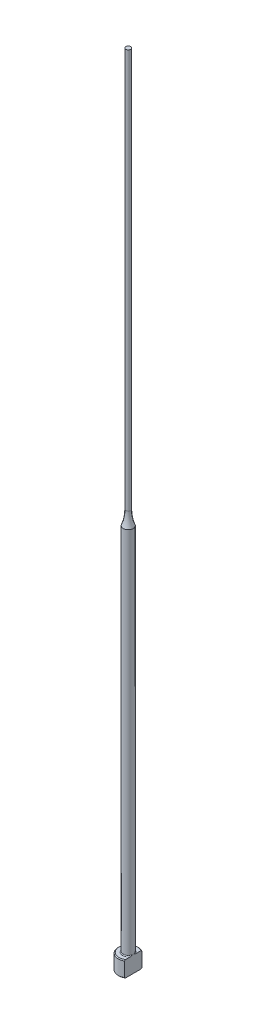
from build123d import *
from build123d.topology import SkipClean

# Parameters (mm, degrees)
CHAMFER1_SIZE    = 0.2
FILLET1_R        = 0.2
KEYED_HEAD_DEPTH = 201.031247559


with BuildPart() as part:
    # Sketch1 → Revolve1 (revolve)
    with BuildSketch(Plane.XY, mode=Mode.PRIVATE) as revolve1_sk:
        with BuildLine():
            Line((0, 0), (-2.5, 0))
            Line((-2.5, 0), (-2.5, 4))
            Line((-2.5, 4), (-1.25, 4))
            Line((-1.25, 4), (-1.25, 96.453522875))
            ThreePointArc((-1.25, 96.453522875), (-0.763842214, 98.197224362), (-0.6, 100))
            Line((-0.6, 100), (-0.6, 200))
            Line((-0.6, 200), (0, 200))
            Line((0, 200), (0, 0))
        make_face()
    revolve(revolve1_sk.sketch.rotate(Axis((0, 259.958771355, 0), (0, -1, 0)), 270), axis=Axis((0, 259.958771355, 0), (0, -1, 0)))

    # Chamfer1
    chamfer1_edges = [part.edges().sort_by_distance(p)[0] for p in [
        (0, 0, -2.5),
        (0, 4, -2.5),
    ]]
    chamfer(chamfer1_edges, length=CHAMFER1_SIZE)

    # Fillet1
    fillet1_edges = [part.edges().sort_by_distance(p)[0] for p in [
        (0, 4, -1.25),
    ]]
    fillet(fillet1_edges, radius=FILLET1_R)

    # Sketch2 → Keyed Head (cut, through all)
    with SkipClean():  # the faces are left unmerged after this step: merging them gives an invalid solid
        with BuildSketch(Plane(origin=(0, 0, 0), x_dir=(1, 0, 0), z_dir=(0, 1, 0))):
            with BuildLine():
                Line((1.25, -2.165063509), (1.25, 2.165063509))
                ThreePointArc((1.25, 2.165063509), (2.5, 0), (1.25, -2.165063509))
            make_face()
        extrude(amount=KEYED_HEAD_DEPTH, mode=Mode.SUBTRACT)


solid = part.part
